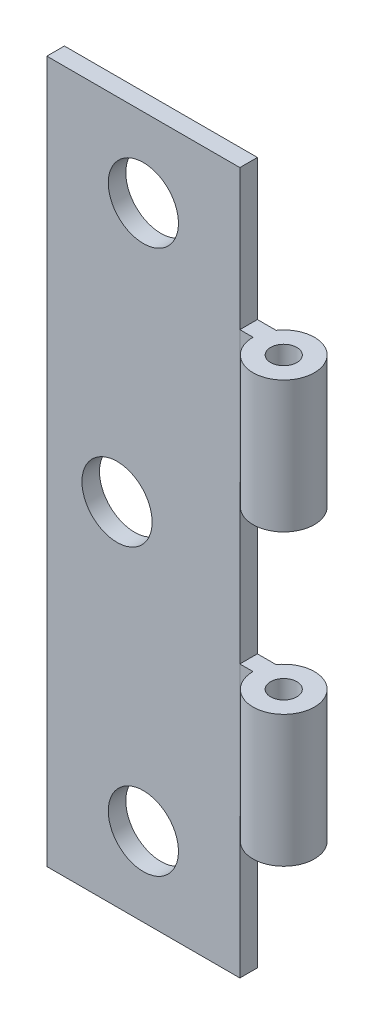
from build123d import *

# Parameters (mm, degrees)
SKETCH1_W               = 17.4625
SKETCH1_H               = 63.5
BOSS_EXTRUDE1_DEPTH     = 1.5875
SKETCH3_R               = 2.778125
SKETCH3_R_2             = 1.190625
SKETCH3_W               = 1.6888767
SKETCH3_H               = 1.5875
BOSS_EXTRUDE2_DEPTH     = 63.5
SKETCH4_R               = 3.175
CUT_EXTRUDE1_DEPTH      = 36.590638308
CUT_EXTRUDE3_DEPTH      = 36.590638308
CUT_EXTRUDE3_DEPTH_BACK = 36.590638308
SKETCH5_W               = 6.746875
SKETCH5_H               = 0.79375
SKETCH5_H_2             = 1.5875
SKETCH5_H_3             = 11.90625


with BuildPart() as part:
    # Sketch1 → Boss-Extrude1 (new body)
    with BuildSketch(Plane.XY):
        Rectangle(SKETCH1_W, SKETCH1_H)
    extrude(amount=-BOSS_EXTRUDE1_DEPTH)

    # Sketch4 → Cut-Extrude1 (cut, through all)
    with BuildSketch(Plane(origin=(0, 0, -1.5875), x_dir=(-1, 0, 0), z_dir=(0, 0, -1))):
        with Locations((0, 24.60625)):
            Circle(SKETCH4_R)
        with Locations((2.38125, 0)):
            Circle(SKETCH4_R)
        with Locations((0, -24.60625)):
            Circle(SKETCH4_R)
    extrude(amount=-CUT_EXTRUDE1_DEPTH, mode=Mode.SUBTRACT)


with BuildPart() as body_2:
    # Sketch3 → Boss-Extrude2 (new body)
    # profile 1 of 2: a face of its own
    with BuildSketch(Plane(origin=(0, 31.75, 0), x_dir=(1, 0, 0), z_dir=(0, 1, 0))):
        with Locations((12.7, 0)):
            Circle(SKETCH3_R)
        with Locations(Location((12.7, 0, 0), (0, 0, 270))):
            Circle(SKETCH3_R_2, mode=Mode.SUBTRACT)
    # profile 2 of 2: a face of its own
    with BuildSketch(Plane(origin=(0, 31.75, 0), x_dir=(1, 0, 0), z_dir=(0, 1, 0))):
        with Locations((9.57568835, 0.79375)):
            Rectangle(SKETCH3_W, SKETCH3_H)
    extrude(amount=-BOSS_EXTRUDE2_DEPTH)

    # Sketch5 → Cut-Extrude3 (cut, two sides: drawn at the far end of the back side and taken through both)
    with BuildSketch(Plane(origin=(0, 0, -1.5875), x_dir=(-1, 0, 0), z_dir=(0, 0, -1)).offset(-CUT_EXTRUDE3_DEPTH_BACK)):
        with Locations((-12.1046875, 19.446875)):
            Rectangle(SKETCH5_W, SKETCH5_H)
        with Locations((-12.1046875, 6.35)):
            Rectangle(SKETCH5_W, SKETCH5_H_2)
        with Locations((-12.1046875, -6.746875)):
            Rectangle(SKETCH5_W, SKETCH5_H)
        with Locations((-12.1046875, -19.446875)):
            Rectangle(SKETCH5_W, SKETCH5_H)
        with Locations((-12.1046875, -25.796875)):
            Rectangle(SKETCH5_W, SKETCH5_H_3)
        with Locations((-12.1046875, -0.396875)):
            Rectangle(SKETCH5_W, SKETCH5_H_3)
        with Locations((-12.1046875, 25.796875)):
            Rectangle(SKETCH5_W, SKETCH5_H_3)
    extrude(amount=CUT_EXTRUDE3_DEPTH + CUT_EXTRUDE3_DEPTH_BACK, mode=Mode.SUBTRACT)


with BuildPart() as cut_extrude3_piece_1:
    # of the separate pieces the step leaves, piece 1, a body of its own (cut_extrude3_pieces)
    add(body_2.part.solids().sort_by_distance((10.4201267, -7.14375, -1.5875))[0])


with BuildPart() as cut_extrude3_piece_2:
    # of the separate pieces the step leaves, piece 2, a body of its own (cut_extrude3_pieces)
    add(body_2.part.solids().sort_by_distance((10.4201267, 19.05, -1.5875))[0])


solid = Compound([part.part, cut_extrude3_piece_1.part, cut_extrude3_piece_2.part])
